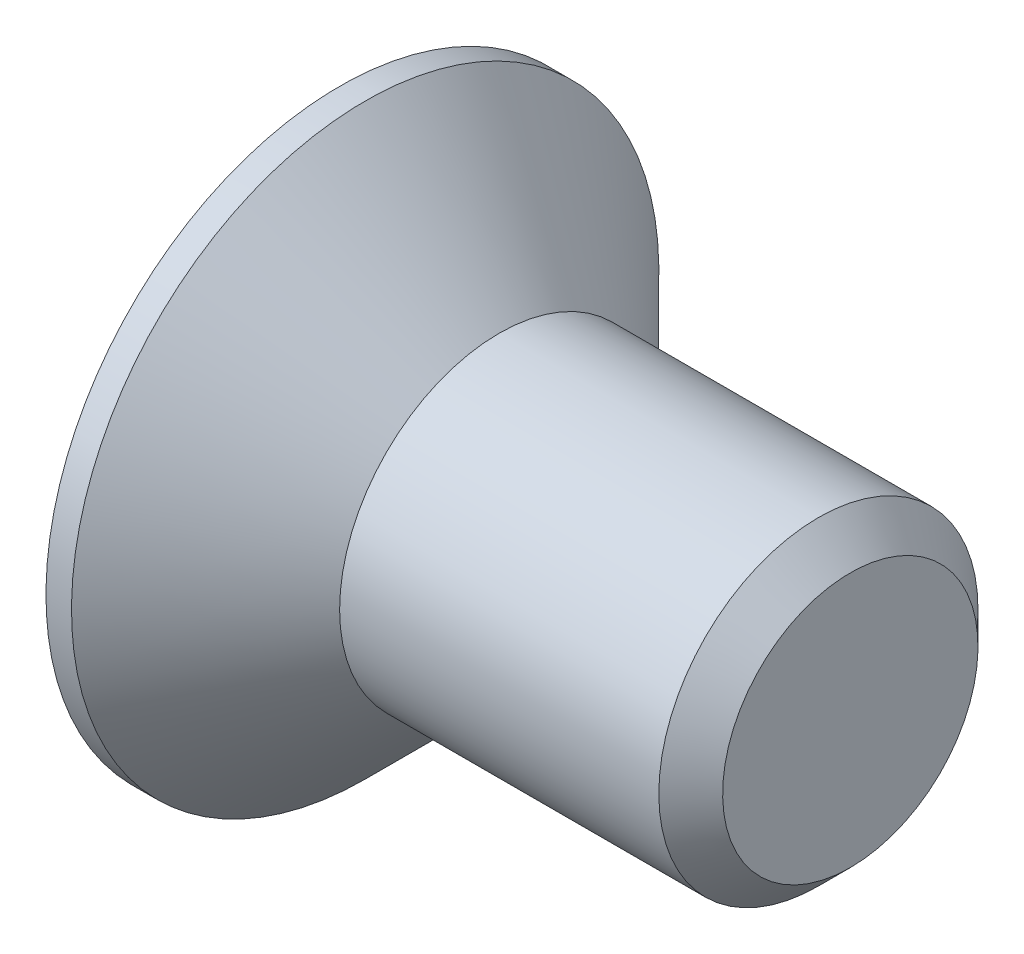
ISO-10303-21;
HEADER;
FILE_DESCRIPTION(('STEP AP214'),'2;1');
FILE_NAME('part.step','',(''),(''),'','','');
FILE_SCHEMA(('AUTOMOTIVE_DESIGN { 1 0 10303 214 1 1 1 1 }'));
ENDSEC;
DATA;
#1=APPLICATION_CONTEXT('core data for automotive mechanical design processes');
#2=APPLICATION_PROTOCOL_DEFINITION('international standard','automotive_design',2000,#1);
#3=PRODUCT_CONTEXT('',#1,'mechanical');
#4=PRODUCT('Part','Part','',(#3));
#5=PRODUCT_RELATED_PRODUCT_CATEGORY('part','',(#4));
#6=PRODUCT_DEFINITION_FORMATION('','',#4);
#7=PRODUCT_DEFINITION_CONTEXT('part definition',#1,'design');
#8=PRODUCT_DEFINITION('design','',#6,#7);
#9=PRODUCT_DEFINITION_SHAPE('','',#8);
#10=(LENGTH_UNIT() NAMED_UNIT(*) SI_UNIT(.MILLI.,.METRE.));
#11=(NAMED_UNIT(*) PLANE_ANGLE_UNIT() SI_UNIT($,.RADIAN.));
#12=(NAMED_UNIT(*) SI_UNIT($,.STERADIAN.) SOLID_ANGLE_UNIT());
#13=UNCERTAINTY_MEASURE_WITH_UNIT(LENGTH_MEASURE(1.E-05),#10,'distance_accuracy_value','');
#14=(GEOMETRIC_REPRESENTATION_CONTEXT(3) GLOBAL_UNCERTAINTY_ASSIGNED_CONTEXT((#13)) GLOBAL_UNIT_ASSIGNED_CONTEXT((#10,
#11,#12)) REPRESENTATION_CONTEXT('',''));
#15=CARTESIAN_POINT('',(0.,0.,0.));
#16=DIRECTION('',(0.,0.,1.));
#17=DIRECTION('',(1.,0.,0.));
#18=AXIS2_PLACEMENT_3D('',#15,#16,#17);
#19=CARTESIAN_POINT('',(0.,0.,0.));
#20=DIRECTION('',(-1.,0.,0.));
#21=DIRECTION('',(0.,-1.,0.));
#22=AXIS2_PLACEMENT_3D('',#19,#20,#21);
#23=CONICAL_SURFACE('',#22,2.5,0.78539816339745);
#24=CARTESIAN_POINT('',(-2.09999999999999,0.,0.));
#25=DIRECTION('',(-1.,0.,0.));
#26=DIRECTION('',(0.,-1.,0.));
#27=AXIS2_PLACEMENT_3D('',#24,#25,#26);
#28=CIRCLE('',#27,4.6);
#29=CARTESIAN_POINT('',(-2.09999999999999,-4.6,0.));
#30=VERTEX_POINT('',#29);
#31=EDGE_CURVE('E189',#30,#30,#28,.T.);
#32=ORIENTED_EDGE('',*,*,#31,.F.);
#33=EDGE_LOOP('',(#32));
#34=FACE_BOUND('',#33,.T.);
#35=CARTESIAN_POINT('',(0.,0.,0.));
#36=DIRECTION('',(-1.,0.,0.));
#37=DIRECTION('',(0.,-1.,0.));
#38=AXIS2_PLACEMENT_3D('',#35,#36,#37);
#39=CIRCLE('',#38,2.5);
#40=CARTESIAN_POINT('',(0.,-2.5,0.));
#41=VERTEX_POINT('',#40);
#42=EDGE_CURVE('E212',#41,#41,#39,.T.);
#43=ORIENTED_EDGE('',*,*,#42,.T.);
#44=EDGE_LOOP('',(#43));
#45=FACE_BOUND('',#44,.T.);
#46=ADVANCED_FACE('F33',(#34,#45),#23,.T.);
#47=CARTESIAN_POINT('',(-2.5,0.,0.));
#48=DIRECTION('',(-1.,0.,0.));
#49=DIRECTION('',(0.,-1.,0.));
#50=AXIS2_PLACEMENT_3D('',#47,#48,#49);
#51=CYLINDRICAL_SURFACE('',#50,2.5);
#52=CARTESIAN_POINT('',(5.,0.,0.));
#53=DIRECTION('',(-1.,0.,0.));
#54=DIRECTION('',(0.,-1.,0.));
#55=AXIS2_PLACEMENT_3D('',#52,#53,#54);
#56=CIRCLE('',#55,2.5);
#57=CARTESIAN_POINT('',(5.,-2.5,0.));
#58=VERTEX_POINT('',#57);
#59=EDGE_CURVE('E41',#58,#58,#56,.T.);
#60=ORIENTED_EDGE('',*,*,#59,.T.);
#61=EDGE_LOOP('',(#60));
#62=FACE_BOUND('',#61,.T.);
#63=ORIENTED_EDGE('',*,*,#42,.F.);
#64=EDGE_LOOP('',(#63));
#65=FACE_BOUND('',#64,.T.);
#66=ADVANCED_FACE('F217',(#62,#65),#51,.T.);
#67=CARTESIAN_POINT('',(5.5,0.,0.));
#68=DIRECTION('',(-1.,0.,0.));
#69=DIRECTION('',(0.,-1.,0.));
#70=AXIS2_PLACEMENT_3D('',#67,#68,#69);
#71=PLANE('',#70);
#72=CARTESIAN_POINT('',(5.5,0.,0.));
#73=DIRECTION('',(-1.,0.,0.));
#74=DIRECTION('',(0.,-1.,0.));
#75=AXIS2_PLACEMENT_3D('',#72,#73,#74);
#76=CIRCLE('',#75,2.);
#77=CARTESIAN_POINT('',(5.5,-2.,0.));
#78=VERTEX_POINT('',#77);
#79=EDGE_CURVE('E11',#78,#78,#76,.F.);
#80=ORIENTED_EDGE('',*,*,#79,.T.);
#81=EDGE_LOOP('',(#80));
#82=FACE_BOUND('',#81,.T.);
#83=ADVANCED_FACE('F239',(#82),#71,.F.);
#84=CARTESIAN_POINT('',(-2.5,4.6,0.));
#85=DIRECTION('',(1.,0.,0.));
#86=DIRECTION('',(0.,1.,0.));
#87=AXIS2_PLACEMENT_3D('',#84,#85,#86);
#88=PLANE('',#87);
#89=DIRECTION('',(0.,0.,-1.));
#90=VECTOR('',#89,1.);
#91=CARTESIAN_POINT('',(-2.5,0.575,-2.3));
#92=LINE('',#91,#90);
#93=CARTESIAN_POINT('',(-2.5,0.575,-0.575));
#94=VERTEX_POINT('',#93);
#95=CARTESIAN_POINT('',(-2.5,0.575,-2.3));
#96=VERTEX_POINT('',#95);
#97=EDGE_CURVE('E158',#94,#96,#92,.T.);
#98=ORIENTED_EDGE('',*,*,#97,.F.);
#99=DIRECTION('',(0.,-1.,0.));
#100=VECTOR('',#99,1.);
#101=CARTESIAN_POINT('',(-2.5,0.575,-0.575));
#102=LINE('',#101,#100);
#103=CARTESIAN_POINT('',(-2.5,2.3,-0.575));
#104=VERTEX_POINT('',#103);
#105=EDGE_CURVE('E48',#104,#94,#102,.T.);
#106=ORIENTED_EDGE('',*,*,#105,.F.);
#107=DIRECTION('',(0.,0.,-1.));
#108=VECTOR('',#107,1.);
#109=CARTESIAN_POINT('',(-2.5,2.3,-0.575));
#110=LINE('',#109,#108);
#111=CARTESIAN_POINT('',(-2.5,2.3,0.575));
#112=VERTEX_POINT('',#111);
#113=EDGE_CURVE('E185',#112,#104,#110,.T.);
#114=ORIENTED_EDGE('',*,*,#113,.F.);
#115=DIRECTION('',(0.,1.,0.));
#116=VECTOR('',#115,1.);
#117=CARTESIAN_POINT('',(-2.5,2.3,0.575));
#118=LINE('',#117,#116);
#119=CARTESIAN_POINT('',(-2.5,0.575,0.575));
#120=VERTEX_POINT('',#119);
#121=EDGE_CURVE('E183',#120,#112,#118,.T.);
#122=ORIENTED_EDGE('',*,*,#121,.F.);
#123=DIRECTION('',(0.,0.,-1.));
#124=VECTOR('',#123,1.);
#125=CARTESIAN_POINT('',(-2.5,0.575,0.575));
#126=LINE('',#125,#124);
#127=CARTESIAN_POINT('',(-2.5,0.575,2.3));
#128=VERTEX_POINT('',#127);
#129=EDGE_CURVE('E132',#128,#120,#126,.T.);
#130=ORIENTED_EDGE('',*,*,#129,.F.);
#131=DIRECTION('',(0.,1.,0.));
#132=VECTOR('',#131,1.);
#133=CARTESIAN_POINT('',(-2.5,0.575,2.3));
#134=LINE('',#133,#132);
#135=CARTESIAN_POINT('',(-2.5,-0.575,2.3));
#136=VERTEX_POINT('',#135);
#137=EDGE_CURVE('E179',#136,#128,#134,.T.);
#138=ORIENTED_EDGE('',*,*,#137,.F.);
#139=DIRECTION('',(0.,0.,1.));
#140=VECTOR('',#139,1.);
#141=CARTESIAN_POINT('',(-2.5,-0.575,2.3));
#142=LINE('',#141,#140);
#143=CARTESIAN_POINT('',(-2.5,-0.575,0.575));
#144=VERTEX_POINT('',#143);
#145=EDGE_CURVE('E176',#144,#136,#142,.T.);
#146=ORIENTED_EDGE('',*,*,#145,.F.);
#147=DIRECTION('',(0.,1.,0.));
#148=VECTOR('',#147,1.);
#149=CARTESIAN_POINT('',(-2.5,-0.575,0.575));
#150=LINE('',#149,#148);
#151=CARTESIAN_POINT('',(-2.5,-2.3,0.575));
#152=VERTEX_POINT('',#151);
#153=EDGE_CURVE('E173',#152,#144,#150,.T.);
#154=ORIENTED_EDGE('',*,*,#153,.F.);
#155=DIRECTION('',(0.,0.,1.));
#156=VECTOR('',#155,1.);
#157=CARTESIAN_POINT('',(-2.5,-2.3,0.575));
#158=LINE('',#157,#156);
#159=CARTESIAN_POINT('',(-2.5,-2.3,-0.575));
#160=VERTEX_POINT('',#159);
#161=EDGE_CURVE('E170',#160,#152,#158,.T.);
#162=ORIENTED_EDGE('',*,*,#161,.F.);
#163=DIRECTION('',(0.,-1.,0.));
#164=VECTOR('',#163,1.);
#165=CARTESIAN_POINT('',(-2.5,-2.3,-0.575));
#166=LINE('',#165,#164);
#167=CARTESIAN_POINT('',(-2.5,-0.575,-0.575));
#168=VERTEX_POINT('',#167);
#169=EDGE_CURVE('E167',#168,#160,#166,.T.);
#170=ORIENTED_EDGE('',*,*,#169,.F.);
#171=DIRECTION('',(0.,0.,1.));
#172=VECTOR('',#171,1.);
#173=CARTESIAN_POINT('',(-2.5,-0.575,-0.575));
#174=LINE('',#173,#172);
#175=CARTESIAN_POINT('',(-2.5,-0.575,-2.3));
#176=VERTEX_POINT('',#175);
#177=EDGE_CURVE('E164',#176,#168,#174,.T.);
#178=ORIENTED_EDGE('',*,*,#177,.F.);
#179=DIRECTION('',(0.,-1.,0.));
#180=VECTOR('',#179,1.);
#181=CARTESIAN_POINT('',(-2.5,-0.575,-2.3));
#182=LINE('',#181,#180);
#183=EDGE_CURVE('E161',#96,#176,#182,.T.);
#184=ORIENTED_EDGE('',*,*,#183,.F.);
#185=EDGE_LOOP('',(#98,#106,#114,#122,#130,#138,#146,#154,#162,#170,#178,#184));
#186=FACE_BOUND('',#185,.T.);
#187=CARTESIAN_POINT('',(-2.5,0.,0.));
#188=DIRECTION('',(-1.,0.,0.));
#189=DIRECTION('',(0.,-1.,0.));
#190=AXIS2_PLACEMENT_3D('',#187,#188,#189);
#191=CIRCLE('',#190,4.6);
#192=CARTESIAN_POINT('',(-2.5,-4.6,0.));
#193=VERTEX_POINT('',#192);
#194=EDGE_CURVE('E209',#193,#193,#191,.T.);
#195=ORIENTED_EDGE('',*,*,#194,.T.);
#196=EDGE_LOOP('',(#195));
#197=FACE_BOUND('',#196,.T.);
#198=ADVANCED_FACE('F230',(#186,#197),#88,.F.);
#199=CARTESIAN_POINT('',(-2.5,0.,0.));
#200=DIRECTION('',(-1.,0.,0.));
#201=DIRECTION('',(0.,-1.,0.));
#202=AXIS2_PLACEMENT_3D('',#199,#200,#201);
#203=CYLINDRICAL_SURFACE('',#202,4.6);
#204=ORIENTED_EDGE('',*,*,#194,.F.);
#205=EDGE_LOOP('',(#204));
#206=FACE_BOUND('',#205,.T.);
#207=ORIENTED_EDGE('',*,*,#31,.T.);
#208=EDGE_LOOP('',(#207));
#209=FACE_BOUND('',#208,.T.);
#210=ADVANCED_FACE('F222',(#206,#209),#203,.T.);
#211=CARTESIAN_POINT('',(5.,0.,0.));
#212=DIRECTION('',(-1.,0.,0.));
#213=DIRECTION('',(0.,-1.,0.));
#214=AXIS2_PLACEMENT_3D('',#211,#212,#213);
#215=CONICAL_SURFACE('',#214,2.5,0.785398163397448);
#216=ORIENTED_EDGE('',*,*,#79,.F.);
#217=EDGE_LOOP('',(#216));
#218=FACE_BOUND('',#217,.T.);
#219=ORIENTED_EDGE('',*,*,#59,.F.);
#220=EDGE_LOOP('',(#219));
#221=FACE_BOUND('',#220,.T.);
#222=ADVANCED_FACE('F35',(#218,#221),#215,.T.);
#223=CARTESIAN_POINT('',(-0.4,0.575,-0.575));
#224=DIRECTION('',(0.,0.,-1.));
#225=DIRECTION('',(-1.,0.,0.));
#226=AXIS2_PLACEMENT_3D('',#223,#224,#225);
#227=PLANE('',#226);
#228=ORIENTED_EDGE('',*,*,#105,.T.);
#229=DIRECTION('',(-1.,0.,0.));
#230=VECTOR('',#229,1.);
#231=CARTESIAN_POINT('',(-0.4,0.575,-0.575));
#232=LINE('',#231,#230);
#233=CARTESIAN_POINT('',(-0.4,0.575,-0.575));
#234=VERTEX_POINT('',#233);
#235=EDGE_CURVE('E96',#234,#94,#232,.T.);
#236=ORIENTED_EDGE('',*,*,#235,.F.);
#237=DIRECTION('',(0.,-1.,0.));
#238=VECTOR('',#237,1.);
#239=CARTESIAN_POINT('',(-0.4,0.575,-0.575));
#240=LINE('',#239,#238);
#241=CARTESIAN_POINT('',(-0.4,2.3,-0.575));
#242=VERTEX_POINT('',#241);
#243=EDGE_CURVE('E187',#242,#234,#240,.T.);
#244=ORIENTED_EDGE('',*,*,#243,.F.);
#245=DIRECTION('',(-1.,0.,0.));
#246=VECTOR('',#245,1.);
#247=CARTESIAN_POINT('',(-0.4,2.3,-0.575));
#248=LINE('',#247,#246);
#249=EDGE_CURVE('E56',#242,#104,#248,.T.);
#250=ORIENTED_EDGE('',*,*,#249,.T.);
#251=EDGE_LOOP('',(#228,#236,#244,#250));
#252=FACE_BOUND('',#251,.T.);
#253=ADVANCED_FACE('F221',(#252),#227,.F.);
#254=CARTESIAN_POINT('',(-0.4,2.3,-0.575));
#255=DIRECTION('',(0.,1.,0.));
#256=DIRECTION('',(-1.,0.,0.));
#257=AXIS2_PLACEMENT_3D('',#254,#255,#256);
#258=PLANE('',#257);
#259=ORIENTED_EDGE('',*,*,#113,.T.);
#260=ORIENTED_EDGE('',*,*,#249,.F.);
#261=DIRECTION('',(0.,0.,-1.));
#262=VECTOR('',#261,1.);
#263=CARTESIAN_POINT('',(-0.4,2.3,-0.575));
#264=LINE('',#263,#262);
#265=CARTESIAN_POINT('',(-0.4,2.3,0.575));
#266=VERTEX_POINT('',#265);
#267=EDGE_CURVE('E144',#266,#242,#264,.T.);
#268=ORIENTED_EDGE('',*,*,#267,.F.);
#269=DIRECTION('',(-1.,0.,0.));
#270=VECTOR('',#269,1.);
#271=CARTESIAN_POINT('',(-0.4,2.3,0.575));
#272=LINE('',#271,#270);
#273=EDGE_CURVE('E136',#266,#112,#272,.T.);
#274=ORIENTED_EDGE('',*,*,#273,.T.);
#275=EDGE_LOOP('',(#259,#260,#268,#274));
#276=FACE_BOUND('',#275,.T.);
#277=ADVANCED_FACE('F228',(#276),#258,.F.);
#278=CARTESIAN_POINT('',(-0.4,2.3,0.575));
#279=DIRECTION('',(0.,0.,1.));
#280=DIRECTION('',(1.,0.,0.));
#281=AXIS2_PLACEMENT_3D('',#278,#279,#280);
#282=PLANE('',#281);
#283=ORIENTED_EDGE('',*,*,#121,.T.);
#284=ORIENTED_EDGE('',*,*,#273,.F.);
#285=DIRECTION('',(0.,1.,0.));
#286=VECTOR('',#285,1.);
#287=CARTESIAN_POINT('',(-0.4,2.3,0.575));
#288=LINE('',#287,#286);
#289=CARTESIAN_POINT('',(-0.4,0.575,0.575));
#290=VERTEX_POINT('',#289);
#291=EDGE_CURVE('E140',#290,#266,#288,.T.);
#292=ORIENTED_EDGE('',*,*,#291,.F.);
#293=DIRECTION('',(-1.,0.,0.));
#294=VECTOR('',#293,1.);
#295=CARTESIAN_POINT('',(-0.4,0.575,0.575));
#296=LINE('',#295,#294);
#297=EDGE_CURVE('E125',#290,#120,#296,.T.);
#298=ORIENTED_EDGE('',*,*,#297,.T.);
#299=EDGE_LOOP('',(#283,#284,#292,#298));
#300=FACE_BOUND('',#299,.T.);
#301=ADVANCED_FACE('F141',(#300),#282,.F.);
#302=CARTESIAN_POINT('',(-0.4,0.575,0.575));
#303=DIRECTION('',(0.,1.,0.));
#304=DIRECTION('',(-1.,0.,0.));
#305=AXIS2_PLACEMENT_3D('',#302,#303,#304);
#306=PLANE('',#305);
#307=ORIENTED_EDGE('',*,*,#129,.T.);
#308=ORIENTED_EDGE('',*,*,#297,.F.);
#309=DIRECTION('',(0.,0.,-1.));
#310=VECTOR('',#309,1.);
#311=CARTESIAN_POINT('',(-0.4,0.575,0.575));
#312=LINE('',#311,#310);
#313=CARTESIAN_POINT('',(-0.4,0.575,2.3));
#314=VERTEX_POINT('',#313);
#315=EDGE_CURVE('E129',#314,#290,#312,.T.);
#316=ORIENTED_EDGE('',*,*,#315,.F.);
#317=DIRECTION('',(-1.,0.,0.));
#318=VECTOR('',#317,1.);
#319=CARTESIAN_POINT('',(-0.4,0.575,2.3));
#320=LINE('',#319,#318);
#321=EDGE_CURVE('E137',#314,#128,#320,.T.);
#322=ORIENTED_EDGE('',*,*,#321,.T.);
#323=EDGE_LOOP('',(#307,#308,#316,#322));
#324=FACE_BOUND('',#323,.T.);
#325=ADVANCED_FACE('F127',(#324),#306,.F.);
#326=CARTESIAN_POINT('',(-0.4,0.575,2.3));
#327=DIRECTION('',(0.,0.,1.));
#328=DIRECTION('',(1.,0.,0.));
#329=AXIS2_PLACEMENT_3D('',#326,#327,#328);
#330=PLANE('',#329);
#331=ORIENTED_EDGE('',*,*,#137,.T.);
#332=ORIENTED_EDGE('',*,*,#321,.F.);
#333=DIRECTION('',(0.,1.,0.));
#334=VECTOR('',#333,1.);
#335=CARTESIAN_POINT('',(-0.4,0.575,2.3));
#336=LINE('',#335,#334);
#337=CARTESIAN_POINT('',(-0.4,-0.575,2.3));
#338=VERTEX_POINT('',#337);
#339=EDGE_CURVE('E150',#338,#314,#336,.T.);
#340=ORIENTED_EDGE('',*,*,#339,.F.);
#341=DIRECTION('',(-1.,0.,0.));
#342=VECTOR('',#341,1.);
#343=CARTESIAN_POINT('',(-0.4,-0.575,2.3));
#344=LINE('',#343,#342);
#345=EDGE_CURVE('E192',#338,#136,#344,.T.);
#346=ORIENTED_EDGE('',*,*,#345,.T.);
#347=EDGE_LOOP('',(#331,#332,#340,#346));
#348=FACE_BOUND('',#347,.T.);
#349=ADVANCED_FACE('F277',(#348),#330,.F.);
#350=CARTESIAN_POINT('',(-0.4,-0.575,2.3));
#351=DIRECTION('',(0.,-1.,0.));
#352=DIRECTION('',(1.,0.,0.));
#353=AXIS2_PLACEMENT_3D('',#350,#351,#352);
#354=PLANE('',#353);
#355=ORIENTED_EDGE('',*,*,#145,.T.);
#356=ORIENTED_EDGE('',*,*,#345,.F.);
#357=DIRECTION('',(0.,0.,1.));
#358=VECTOR('',#357,1.);
#359=CARTESIAN_POINT('',(-0.4,-0.575,2.3));
#360=LINE('',#359,#358);
#361=CARTESIAN_POINT('',(-0.4,-0.575,0.575));
#362=VERTEX_POINT('',#361);
#363=EDGE_CURVE('E152',#362,#338,#360,.T.);
#364=ORIENTED_EDGE('',*,*,#363,.F.);
#365=DIRECTION('',(-1.,0.,0.));
#366=VECTOR('',#365,1.);
#367=CARTESIAN_POINT('',(-0.4,-0.575,0.575));
#368=LINE('',#367,#366);
#369=EDGE_CURVE('E194',#362,#144,#368,.T.);
#370=ORIENTED_EDGE('',*,*,#369,.T.);
#371=EDGE_LOOP('',(#355,#356,#364,#370));
#372=FACE_BOUND('',#371,.T.);
#373=ADVANCED_FACE('F273',(#372),#354,.F.);
#374=CARTESIAN_POINT('',(-0.4,-0.575,0.575));
#375=DIRECTION('',(0.,0.,1.));
#376=DIRECTION('',(1.,0.,0.));
#377=AXIS2_PLACEMENT_3D('',#374,#375,#376);
#378=PLANE('',#377);
#379=ORIENTED_EDGE('',*,*,#153,.T.);
#380=ORIENTED_EDGE('',*,*,#369,.F.);
#381=DIRECTION('',(0.,1.,0.));
#382=VECTOR('',#381,1.);
#383=CARTESIAN_POINT('',(-0.4,-0.575,0.575));
#384=LINE('',#383,#382);
#385=CARTESIAN_POINT('',(-0.4,-2.3,0.575));
#386=VERTEX_POINT('',#385);
#387=EDGE_CURVE('E422',#386,#362,#384,.T.);
#388=ORIENTED_EDGE('',*,*,#387,.F.);
#389=DIRECTION('',(-1.,0.,0.));
#390=VECTOR('',#389,1.);
#391=CARTESIAN_POINT('',(-0.4,-2.3,0.575));
#392=LINE('',#391,#390);
#393=EDGE_CURVE('E196',#386,#152,#392,.T.);
#394=ORIENTED_EDGE('',*,*,#393,.T.);
#395=EDGE_LOOP('',(#379,#380,#388,#394));
#396=FACE_BOUND('',#395,.T.);
#397=ADVANCED_FACE('F269',(#396),#378,.F.);
#398=CARTESIAN_POINT('',(-0.4,-2.3,0.575));
#399=DIRECTION('',(0.,-1.,0.));
#400=DIRECTION('',(1.,0.,0.));
#401=AXIS2_PLACEMENT_3D('',#398,#399,#400);
#402=PLANE('',#401);
#403=ORIENTED_EDGE('',*,*,#161,.T.);
#404=ORIENTED_EDGE('',*,*,#393,.F.);
#405=DIRECTION('',(0.,0.,1.));
#406=VECTOR('',#405,1.);
#407=CARTESIAN_POINT('',(-0.4,-2.3,0.575));
#408=LINE('',#407,#406);
#409=CARTESIAN_POINT('',(-0.4,-2.3,-0.575));
#410=VERTEX_POINT('',#409);
#411=EDGE_CURVE('E419',#410,#386,#408,.T.);
#412=ORIENTED_EDGE('',*,*,#411,.F.);
#413=DIRECTION('',(-1.,0.,0.));
#414=VECTOR('',#413,1.);
#415=CARTESIAN_POINT('',(-0.4,-2.3,-0.575));
#416=LINE('',#415,#414);
#417=EDGE_CURVE('E198',#410,#160,#416,.T.);
#418=ORIENTED_EDGE('',*,*,#417,.T.);
#419=EDGE_LOOP('',(#403,#404,#412,#418));
#420=FACE_BOUND('',#419,.T.);
#421=ADVANCED_FACE('F265',(#420),#402,.F.);
#422=CARTESIAN_POINT('',(-0.4,-2.3,-0.575));
#423=DIRECTION('',(0.,0.,-1.));
#424=DIRECTION('',(-1.,0.,0.));
#425=AXIS2_PLACEMENT_3D('',#422,#423,#424);
#426=PLANE('',#425);
#427=ORIENTED_EDGE('',*,*,#169,.T.);
#428=ORIENTED_EDGE('',*,*,#417,.F.);
#429=DIRECTION('',(0.,-1.,0.));
#430=VECTOR('',#429,1.);
#431=CARTESIAN_POINT('',(-0.4,-2.3,-0.575));
#432=LINE('',#431,#430);
#433=CARTESIAN_POINT('',(-0.4,-0.575,-0.575));
#434=VERTEX_POINT('',#433);
#435=EDGE_CURVE('E416',#434,#410,#432,.T.);
#436=ORIENTED_EDGE('',*,*,#435,.F.);
#437=DIRECTION('',(-1.,0.,0.));
#438=VECTOR('',#437,1.);
#439=CARTESIAN_POINT('',(-0.4,-0.575,-0.575));
#440=LINE('',#439,#438);
#441=EDGE_CURVE('E200',#434,#168,#440,.T.);
#442=ORIENTED_EDGE('',*,*,#441,.T.);
#443=EDGE_LOOP('',(#427,#428,#436,#442));
#444=FACE_BOUND('',#443,.T.);
#445=ADVANCED_FACE('F261',(#444),#426,.F.);
#446=CARTESIAN_POINT('',(-0.4,-0.575,-0.575));
#447=DIRECTION('',(0.,-1.,0.));
#448=DIRECTION('',(1.,0.,0.));
#449=AXIS2_PLACEMENT_3D('',#446,#447,#448);
#450=PLANE('',#449);
#451=ORIENTED_EDGE('',*,*,#177,.T.);
#452=ORIENTED_EDGE('',*,*,#441,.F.);
#453=DIRECTION('',(0.,0.,1.));
#454=VECTOR('',#453,1.);
#455=CARTESIAN_POINT('',(-0.4,-0.575,-0.575));
#456=LINE('',#455,#454);
#457=CARTESIAN_POINT('',(-0.4,-0.575,-2.3));
#458=VERTEX_POINT('',#457);
#459=EDGE_CURVE('E413',#458,#434,#456,.T.);
#460=ORIENTED_EDGE('',*,*,#459,.F.);
#461=DIRECTION('',(-1.,0.,0.));
#462=VECTOR('',#461,1.);
#463=CARTESIAN_POINT('',(-0.4,-0.575,-2.3));
#464=LINE('',#463,#462);
#465=EDGE_CURVE('E202',#458,#176,#464,.T.);
#466=ORIENTED_EDGE('',*,*,#465,.T.);
#467=EDGE_LOOP('',(#451,#452,#460,#466));
#468=FACE_BOUND('',#467,.T.);
#469=ADVANCED_FACE('F257',(#468),#450,.F.);
#470=CARTESIAN_POINT('',(-0.4,-0.575,-2.3));
#471=DIRECTION('',(0.,0.,-1.));
#472=DIRECTION('',(-1.,0.,0.));
#473=AXIS2_PLACEMENT_3D('',#470,#471,#472);
#474=PLANE('',#473);
#475=ORIENTED_EDGE('',*,*,#183,.T.);
#476=ORIENTED_EDGE('',*,*,#465,.F.);
#477=DIRECTION('',(0.,-1.,0.));
#478=VECTOR('',#477,1.);
#479=CARTESIAN_POINT('',(-0.4,-0.575,-2.3));
#480=LINE('',#479,#478);
#481=CARTESIAN_POINT('',(-0.4,0.575,-2.3));
#482=VERTEX_POINT('',#481);
#483=EDGE_CURVE('E408',#482,#458,#480,.T.);
#484=ORIENTED_EDGE('',*,*,#483,.F.);
#485=DIRECTION('',(-1.,0.,0.));
#486=VECTOR('',#485,1.);
#487=CARTESIAN_POINT('',(-0.4,0.575,-2.3));
#488=LINE('',#487,#486);
#489=EDGE_CURVE('E204',#482,#96,#488,.T.);
#490=ORIENTED_EDGE('',*,*,#489,.T.);
#491=EDGE_LOOP('',(#475,#476,#484,#490));
#492=FACE_BOUND('',#491,.T.);
#493=ADVANCED_FACE('F253',(#492),#474,.F.);
#494=CARTESIAN_POINT('',(-0.4,0.575,-2.3));
#495=DIRECTION('',(0.,1.,0.));
#496=DIRECTION('',(-1.,0.,0.));
#497=AXIS2_PLACEMENT_3D('',#494,#495,#496);
#498=PLANE('',#497);
#499=ORIENTED_EDGE('',*,*,#97,.T.);
#500=ORIENTED_EDGE('',*,*,#489,.F.);
#501=DIRECTION('',(0.,0.,-1.));
#502=VECTOR('',#501,1.);
#503=CARTESIAN_POINT('',(-0.4,0.575,-2.3));
#504=LINE('',#503,#502);
#505=EDGE_CURVE('E406',#234,#482,#504,.T.);
#506=ORIENTED_EDGE('',*,*,#505,.F.);
#507=ORIENTED_EDGE('',*,*,#235,.T.);
#508=EDGE_LOOP('',(#499,#500,#506,#507));
#509=FACE_BOUND('',#508,.T.);
#510=ADVANCED_FACE('F250',(#509),#498,.F.);
#511=CARTESIAN_POINT('',(-0.4,0.,0.));
#512=DIRECTION('',(1.,0.,0.));
#513=DIRECTION('',(0.,0.,-1.));
#514=AXIS2_PLACEMENT_3D('',#511,#512,#513);
#515=PLANE('',#514);
#516=ORIENTED_EDGE('',*,*,#243,.T.);
#517=ORIENTED_EDGE('',*,*,#505,.T.);
#518=ORIENTED_EDGE('',*,*,#483,.T.);
#519=ORIENTED_EDGE('',*,*,#459,.T.);
#520=ORIENTED_EDGE('',*,*,#435,.T.);
#521=ORIENTED_EDGE('',*,*,#411,.T.);
#522=ORIENTED_EDGE('',*,*,#387,.T.);
#523=ORIENTED_EDGE('',*,*,#363,.T.);
#524=ORIENTED_EDGE('',*,*,#339,.T.);
#525=ORIENTED_EDGE('',*,*,#315,.T.);
#526=ORIENTED_EDGE('',*,*,#291,.T.);
#527=ORIENTED_EDGE('',*,*,#267,.T.);
#528=EDGE_LOOP('',(#516,#517,#518,#519,#520,#521,#522,#523,#524,#525,#526,#527));
#529=FACE_BOUND('',#528,.T.);
#530=ADVANCED_FACE('F147',(#529),#515,.F.);
#531=CLOSED_SHELL('',(#46,#66,#83,#198,#210,#222,#253,#277,#301,#325,#349,#373,#397,#421,#445,
#469,#493,#510,#530));
#532=MANIFOLD_SOLID_BREP('B2',#531);
#533=ADVANCED_BREP_SHAPE_REPRESENTATION('',(#18,#532),#14);
#534=SHAPE_DEFINITION_REPRESENTATION(#9,#533);
ENDSEC;
END-ISO-10303-21;
